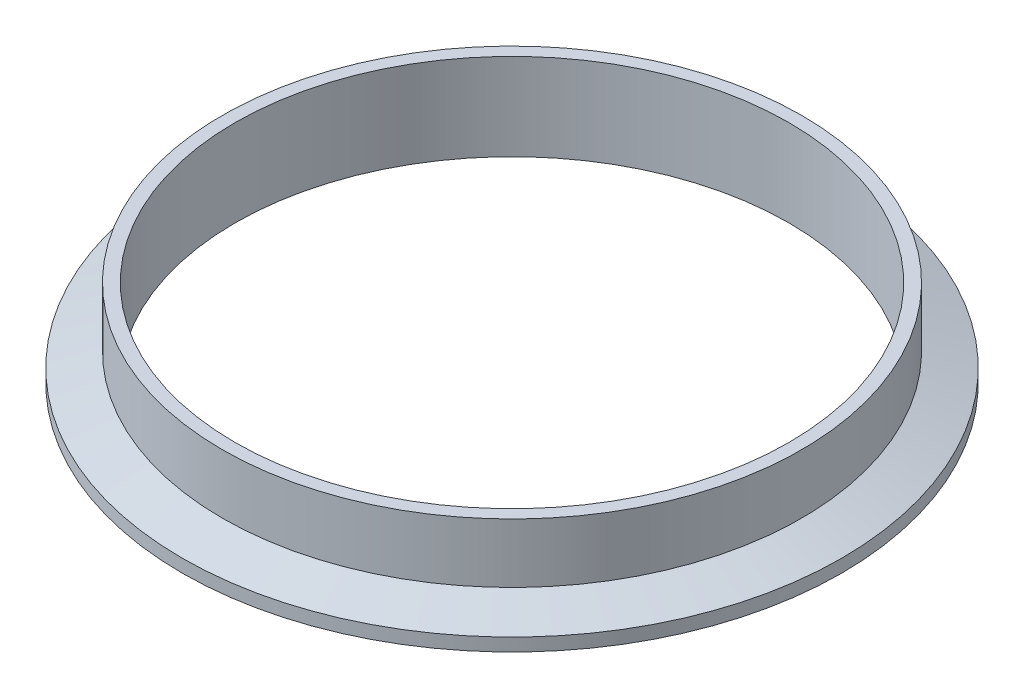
from build123d import *


with BuildPart() as part:
    # Sketch1 → Revolve2 (revolve)
    with BuildSketch(Plane.XY, mode=Mode.PRIVATE) as revolve2_sk:
        with BuildLine():
            Line((-60.7314, 0), (-60.7314, 19.05))
            Line((-60.7314, 19.05), (-63.5, 19.05))
            Line((-63.5, 19.05), (-63.5, 6.043516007))
            Line((-63.5, 6.043516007), (-72.2884, 2.8448))
            Line((-72.2884, 2.8448), (-72.2884, 0))
            Line((-72.2884, 0), (-69.280408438, 0))
            ThreePointArc((-69.280408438, 0), (-68.848211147, 0.129217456), (-68.557866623, 0.474458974))
            ThreePointArc((-68.557866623, 0.474458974), (-67.4624, 1.1938), (-66.366933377, 0.474458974))
            ThreePointArc((-66.366933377, 0.474458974), (-66.076588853, 0.129217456), (-65.644391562, 0))
            Line((-65.644391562, 0), (-60.7314, 0))
        make_face()
    revolve(revolve2_sk.sketch.rotate(Axis((0, 0, 0), (0, 1, 0)), 270), axis=Axis((0, 0, 0), (0, 1, 0)))


solid = part.part
